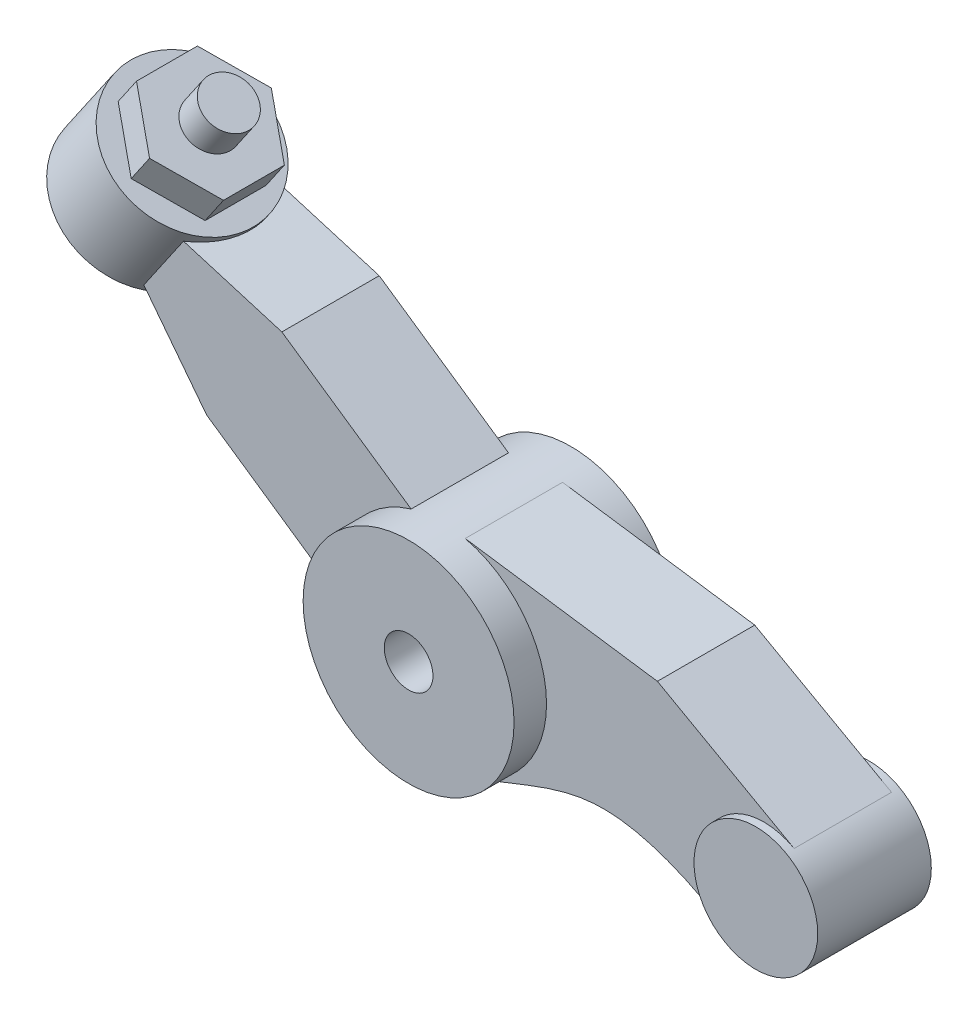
ISO-10303-21;
HEADER;
FILE_DESCRIPTION(('STEP AP214'),'2;1');
FILE_NAME('part.step','',(''),(''),'','','');
FILE_SCHEMA(('AUTOMOTIVE_DESIGN { 1 0 10303 214 1 1 1 1 }'));
ENDSEC;
DATA;
#1=APPLICATION_CONTEXT('core data for automotive mechanical design processes');
#2=APPLICATION_PROTOCOL_DEFINITION('international standard','automotive_design',2000,#1);
#3=PRODUCT_CONTEXT('',#1,'mechanical');
#4=PRODUCT('Part','Part','',(#3));
#5=PRODUCT_RELATED_PRODUCT_CATEGORY('part','',(#4));
#6=PRODUCT_DEFINITION_FORMATION('','',#4);
#7=PRODUCT_DEFINITION_CONTEXT('part definition',#1,'design');
#8=PRODUCT_DEFINITION('design','',#6,#7);
#9=PRODUCT_DEFINITION_SHAPE('','',#8);
#10=(LENGTH_UNIT() NAMED_UNIT(*) SI_UNIT(.MILLI.,.METRE.));
#11=(NAMED_UNIT(*) PLANE_ANGLE_UNIT() SI_UNIT($,.RADIAN.));
#12=(NAMED_UNIT(*) SI_UNIT($,.STERADIAN.) SOLID_ANGLE_UNIT());
#13=UNCERTAINTY_MEASURE_WITH_UNIT(LENGTH_MEASURE(1.E-05),#10,'distance_accuracy_value','');
#14=(GEOMETRIC_REPRESENTATION_CONTEXT(3) GLOBAL_UNCERTAINTY_ASSIGNED_CONTEXT((#13)) GLOBAL_UNIT_ASSIGNED_CONTEXT((#10,
#11,#12)) REPRESENTATION_CONTEXT('',''));
#15=CARTESIAN_POINT('',(0.,0.,0.));
#16=DIRECTION('',(0.,0.,1.));
#17=DIRECTION('',(1.,0.,0.));
#18=AXIS2_PLACEMENT_3D('',#15,#16,#17);
#19=CARTESIAN_POINT('',(0.,0.,1.));
#20=DIRECTION('',(0.,0.,-1.));
#21=DIRECTION('',(-1.,0.,0.));
#22=AXIS2_PLACEMENT_3D('',#19,#20,#21);
#23=CYLINDRICAL_SURFACE('',#22,0.3);
#24=CARTESIAN_POINT('',(0.,0.,1.));
#25=DIRECTION('',(0.,0.,1.));
#26=DIRECTION('',(1.,0.,0.));
#27=AXIS2_PLACEMENT_3D('',#24,#25,#26);
#28=CIRCLE('',#27,0.3);
#29=CARTESIAN_POINT('',(0.3,0.,1.));
#30=VERTEX_POINT('',#29);
#31=EDGE_CURVE('E289',#30,#30,#28,.T.);
#32=ORIENTED_EDGE('',*,*,#31,.T.);
#33=EDGE_LOOP('',(#32));
#34=FACE_BOUND('',#33,.T.);
#35=CARTESIAN_POINT('',(0.,0.,-1.));
#36=DIRECTION('',(0.,0.,1.));
#37=DIRECTION('',(1.,0.,0.));
#38=AXIS2_PLACEMENT_3D('',#35,#36,#37);
#39=CIRCLE('',#38,0.3);
#40=CARTESIAN_POINT('',(0.3,0.,-1.));
#41=VERTEX_POINT('',#40);
#42=EDGE_CURVE('E290',#41,#41,#39,.T.);
#43=ORIENTED_EDGE('',*,*,#42,.F.);
#44=EDGE_LOOP('',(#43));
#45=FACE_BOUND('',#44,.T.);
#46=ADVANCED_FACE('F38',(#34,#45),#23,.F.);
#47=CARTESIAN_POINT('',(0.,0.,1.));
#48=DIRECTION('',(0.,0.,-1.));
#49=DIRECTION('',(-1.,0.,0.));
#50=AXIS2_PLACEMENT_3D('',#47,#48,#49);
#51=CYLINDRICAL_SURFACE('',#50,1.3);
#52=DIRECTION('',(0.,0.,-1.));
#53=VECTOR('',#52,1.);
#54=CARTESIAN_POINT('',(-0.368782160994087,1.24659525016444,0.6));
#55=LINE('',#54,#53);
#56=CARTESIAN_POINT('',(-0.368782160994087,1.24659525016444,0.6));
#57=VERTEX_POINT('',#56);
#58=CARTESIAN_POINT('',(-0.368782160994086,1.24659525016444,-0.6));
#59=VERTEX_POINT('',#58);
#60=EDGE_CURVE('E232',#57,#59,#55,.T.);
#61=ORIENTED_EDGE('',*,*,#60,.F.);
#62=CARTESIAN_POINT('',(0.,0.,0.6));
#63=DIRECTION('',(0.,0.,1.));
#64=DIRECTION('',(1.,0.,0.));
#65=AXIS2_PLACEMENT_3D('',#62,#63,#64);
#66=CIRCLE('',#65,1.3);
#67=CARTESIAN_POINT('',(-1.29584863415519,-0.103809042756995,0.6));
#68=VERTEX_POINT('',#67);
#69=EDGE_CURVE('E200',#57,#68,#66,.T.);
#70=ORIENTED_EDGE('',*,*,#69,.T.);
#71=DIRECTION('',(0.,0.,-1.));
#72=VECTOR('',#71,1.);
#73=CARTESIAN_POINT('',(-1.29584863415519,-0.103809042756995,0.6));
#74=LINE('',#73,#72);
#75=CARTESIAN_POINT('',(-1.29584863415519,-0.103809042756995,-0.6));
#76=VERTEX_POINT('',#75);
#77=EDGE_CURVE('E213',#68,#76,#74,.T.);
#78=ORIENTED_EDGE('',*,*,#77,.T.);
#79=CARTESIAN_POINT('',(0.,0.,-0.6));
#80=DIRECTION('',(0.,0.,1.));
#81=DIRECTION('',(1.,0.,0.));
#82=AXIS2_PLACEMENT_3D('',#79,#80,#81);
#83=CIRCLE('',#82,1.3);
#84=EDGE_CURVE('E199',#59,#76,#83,.T.);
#85=ORIENTED_EDGE('',*,*,#84,.F.);
#86=EDGE_LOOP('',(#61,#70,#78,#85));
#87=FACE_BOUND('',#86,.T.);
#88=DIRECTION('',(0.,0.,-1.));
#89=VECTOR('',#88,1.);
#90=CARTESIAN_POINT('',(0.478482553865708,-1.20874085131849,0.6));
#91=LINE('',#90,#89);
#92=CARTESIAN_POINT('',(0.478482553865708,-1.20874085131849,0.6));
#93=VERTEX_POINT('',#92);
#94=CARTESIAN_POINT('',(0.478482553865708,-1.20874085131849,-0.6));
#95=VERTEX_POINT('',#94);
#96=EDGE_CURVE('E280',#93,#95,#91,.T.);
#97=ORIENTED_EDGE('',*,*,#96,.F.);
#98=CARTESIAN_POINT('',(0.,0.,0.6));
#99=DIRECTION('',(0.,0.,1.));
#100=DIRECTION('',(1.,0.,0.));
#101=AXIS2_PLACEMENT_3D('',#98,#99,#100);
#102=CIRCLE('',#101,1.3);
#103=CARTESIAN_POINT('',(0.297716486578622,1.26545047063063,0.6));
#104=VERTEX_POINT('',#103);
#105=EDGE_CURVE('E313',#93,#104,#102,.T.);
#106=ORIENTED_EDGE('',*,*,#105,.T.);
#107=DIRECTION('',(0.,0.,-1.));
#108=VECTOR('',#107,1.);
#109=CARTESIAN_POINT('',(0.297716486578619,1.26545047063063,0.6));
#110=LINE('',#109,#108);
#111=CARTESIAN_POINT('',(0.297716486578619,1.26545047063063,-0.6));
#112=VERTEX_POINT('',#111);
#113=EDGE_CURVE('E310',#104,#112,#110,.T.);
#114=ORIENTED_EDGE('',*,*,#113,.T.);
#115=CARTESIAN_POINT('',(0.,0.,-0.6));
#116=DIRECTION('',(0.,0.,1.));
#117=DIRECTION('',(1.,0.,0.));
#118=AXIS2_PLACEMENT_3D('',#115,#116,#117);
#119=CIRCLE('',#118,1.3);
#120=EDGE_CURVE('E249',#95,#112,#119,.T.);
#121=ORIENTED_EDGE('',*,*,#120,.F.);
#122=EDGE_LOOP('',(#97,#106,#114,#121));
#123=FACE_BOUND('',#122,.T.);
#124=CARTESIAN_POINT('',(0.,0.,1.));
#125=DIRECTION('',(0.,0.,1.));
#126=DIRECTION('',(1.,0.,0.));
#127=AXIS2_PLACEMENT_3D('',#124,#125,#126);
#128=CIRCLE('',#127,1.3);
#129=CARTESIAN_POINT('',(1.3,0.,1.));
#130=VERTEX_POINT('',#129);
#131=EDGE_CURVE('E284',#130,#130,#128,.T.);
#132=ORIENTED_EDGE('',*,*,#131,.F.);
#133=EDGE_LOOP('',(#132));
#134=FACE_BOUND('',#133,.T.);
#135=CARTESIAN_POINT('',(0.,0.,-1.));
#136=DIRECTION('',(0.,0.,1.));
#137=DIRECTION('',(1.,0.,0.));
#138=AXIS2_PLACEMENT_3D('',#135,#136,#137);
#139=CIRCLE('',#138,1.3);
#140=CARTESIAN_POINT('',(1.3,0.,-1.));
#141=VERTEX_POINT('',#140);
#142=EDGE_CURVE('E287',#141,#141,#139,.T.);
#143=ORIENTED_EDGE('',*,*,#142,.T.);
#144=EDGE_LOOP('',(#143));
#145=FACE_BOUND('',#144,.T.);
#146=ADVANCED_FACE('F266',(#87,#123,#134,#145),#51,.T.);
#147=CARTESIAN_POINT('',(0.,0.,1.));
#148=DIRECTION('',(0.,0.,1.));
#149=DIRECTION('',(1.,0.,0.));
#150=AXIS2_PLACEMENT_3D('',#147,#148,#149);
#151=PLANE('',#150);
#152=ORIENTED_EDGE('',*,*,#31,.F.);
#153=EDGE_LOOP('',(#152));
#154=FACE_BOUND('',#153,.T.);
#155=ORIENTED_EDGE('',*,*,#131,.T.);
#156=EDGE_LOOP('',(#155));
#157=FACE_BOUND('',#156,.T.);
#158=ADVANCED_FACE('F263',(#154,#157),#151,.T.);
#159=CARTESIAN_POINT('',(0.,0.,-1.));
#160=DIRECTION('',(0.,0.,1.));
#161=DIRECTION('',(1.,0.,0.));
#162=AXIS2_PLACEMENT_3D('',#159,#160,#161);
#163=PLANE('',#162);
#164=ORIENTED_EDGE('',*,*,#42,.T.);
#165=EDGE_LOOP('',(#164));
#166=FACE_BOUND('',#165,.T.);
#167=ORIENTED_EDGE('',*,*,#142,.F.);
#168=EDGE_LOOP('',(#167));
#169=FACE_BOUND('',#168,.T.);
#170=ADVANCED_FACE('F260',(#166,#169),#163,.F.);
#171=CARTESIAN_POINT('',(3.50770115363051,-1.28061510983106,0.6));
#172=CARTESIAN_POINT('',(3.03919755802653,-0.994556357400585,0.6));
#173=CARTESIAN_POINT('',(1.95117461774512,-0.508065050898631,0.6));
#174=CARTESIAN_POINT('',(0.933637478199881,-1.05358892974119,0.6));
#175=CARTESIAN_POINT('',(0.478482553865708,-1.20874085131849,0.6));
#176=B_SPLINE_CURVE_WITH_KNOTS('',3,(#171,#172,#173,#174,#175),.UNSPECIFIED.,.F.,.F.,(4,1,4),
(0.,0.533404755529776,1.),.UNSPECIFIED.);
#177=DIRECTION('',(0.,0.,-1.));
#178=VECTOR('',#177,1.);
#179=SURFACE_OF_LINEAR_EXTRUSION('',#176,#178);
#180=CARTESIAN_POINT('',(3.50770115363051,-1.28061510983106,-0.6));
#181=CARTESIAN_POINT('',(3.03919755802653,-0.994556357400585,-0.6));
#182=CARTESIAN_POINT('',(1.95117461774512,-0.508065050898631,-0.6));
#183=CARTESIAN_POINT('',(0.933637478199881,-1.05358892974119,-0.6));
#184=CARTESIAN_POINT('',(0.478482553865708,-1.20874085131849,-0.6));
#185=B_SPLINE_CURVE_WITH_KNOTS('',3,(#180,#181,#182,#183,#184),.UNSPECIFIED.,.F.,.F.,(4,1,4),
(0.,0.533404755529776,1.),.UNSPECIFIED.);
#186=CARTESIAN_POINT('',(3.50770115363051,-1.28061510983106,-0.6));
#187=VERTEX_POINT('',#186);
#188=EDGE_CURVE('E239',#187,#95,#185,.T.);
#189=ORIENTED_EDGE('',*,*,#188,.F.);
#190=DIRECTION('',(0.,0.,-1.));
#191=VECTOR('',#190,1.);
#192=CARTESIAN_POINT('',(3.50770115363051,-1.28061510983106,0.6));
#193=LINE('',#192,#191);
#194=CARTESIAN_POINT('',(3.50770115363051,-1.28061510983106,0.6));
#195=VERTEX_POINT('',#194);
#196=EDGE_CURVE('E295',#195,#187,#193,.T.);
#197=ORIENTED_EDGE('',*,*,#196,.F.);
#198=EDGE_CURVE('E242',#195,#93,#176,.T.);
#199=ORIENTED_EDGE('',*,*,#198,.T.);
#200=ORIENTED_EDGE('',*,*,#96,.T.);
#201=EDGE_LOOP('',(#189,#197,#199,#200));
#202=FACE_BOUND('',#201,.T.);
#203=ADVANCED_FACE('F255',(#202),#179,.T.);
#204=CARTESIAN_POINT('',(1.02851200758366,1.84066803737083,0.6));
#205=DIRECTION('',(0.48778644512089,0.872962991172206,0.));
#206=DIRECTION('',(-0.872962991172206,0.48778644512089,0.));
#207=AXIS2_PLACEMENT_3D('',#204,#205,#206);
#208=PLANE('',#207);
#209=DIRECTION('',(0.872962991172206,-0.48778644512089,0.));
#210=VECTOR('',#209,1.);
#211=CARTESIAN_POINT('',(1.02851200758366,1.84066803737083,-0.6));
#212=LINE('',#211,#210);
#213=CARTESIAN_POINT('',(2.66637346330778,0.925478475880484,-0.6));
#214=VERTEX_POINT('',#213);
#215=CARTESIAN_POINT('',(4.35193716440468,-0.0163657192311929,-0.6));
#216=VERTEX_POINT('',#215);
#217=EDGE_CURVE('E319',#214,#216,#212,.T.);
#218=ORIENTED_EDGE('',*,*,#217,.F.);
#219=DIRECTION('',(0.,0.,-1.));
#220=VECTOR('',#219,1.);
#221=CARTESIAN_POINT('',(2.66637346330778,0.925478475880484,0.6));
#222=LINE('',#221,#220);
#223=CARTESIAN_POINT('',(2.66637346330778,0.925478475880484,0.6));
#224=VERTEX_POINT('',#223);
#225=EDGE_CURVE('E308',#224,#214,#222,.T.);
#226=ORIENTED_EDGE('',*,*,#225,.F.);
#227=DIRECTION('',(0.872962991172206,-0.48778644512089,0.));
#228=VECTOR('',#227,1.);
#229=CARTESIAN_POINT('',(1.02851200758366,1.84066803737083,0.6));
#230=LINE('',#229,#228);
#231=CARTESIAN_POINT('',(4.35193716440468,-0.0163657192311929,0.6));
#232=VERTEX_POINT('',#231);
#233=EDGE_CURVE('E335',#224,#232,#230,.T.);
#234=ORIENTED_EDGE('',*,*,#233,.T.);
#235=DIRECTION('',(0.,0.,-1.));
#236=VECTOR('',#235,1.);
#237=CARTESIAN_POINT('',(4.35193716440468,-0.0163657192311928,0.6));
#238=LINE('',#237,#236);
#239=EDGE_CURVE('E305',#232,#216,#238,.T.);
#240=ORIENTED_EDGE('',*,*,#239,.T.);
#241=EDGE_LOOP('',(#218,#226,#234,#240));
#242=FACE_BOUND('',#241,.T.);
#243=ADVANCED_FACE('F259',(#242),#208,.T.);
#244=CARTESIAN_POINT('',(0.183972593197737,1.28177606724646,0.6));
#245=DIRECTION('',(0.142073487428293,0.989856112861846,0.));
#246=DIRECTION('',(-0.989856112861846,0.142073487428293,0.));
#247=AXIS2_PLACEMENT_3D('',#244,#245,#246);
#248=PLANE('',#247);
#249=DIRECTION('',(0.989856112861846,-0.142073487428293,0.));
#250=VECTOR('',#249,1.);
#251=CARTESIAN_POINT('',(0.183972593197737,1.28177606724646,-0.6));
#252=LINE('',#251,#250);
#253=EDGE_CURVE('E316',#112,#214,#252,.T.);
#254=ORIENTED_EDGE('',*,*,#253,.F.);
#255=ORIENTED_EDGE('',*,*,#113,.F.);
#256=DIRECTION('',(0.989856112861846,-0.142073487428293,0.));
#257=VECTOR('',#256,1.);
#258=CARTESIAN_POINT('',(0.183972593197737,1.28177606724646,0.6));
#259=LINE('',#258,#257);
#260=EDGE_CURVE('E333',#104,#224,#259,.T.);
#261=ORIENTED_EDGE('',*,*,#260,.T.);
#262=ORIENTED_EDGE('',*,*,#225,.T.);
#263=EDGE_LOOP('',(#254,#255,#261,#262));
#264=FACE_BOUND('',#263,.T.);
#265=ADVANCED_FACE('F353',(#264),#248,.T.);
#266=CARTESIAN_POINT('',(0.,0.,0.6));
#267=DIRECTION('',(0.,0.,1.));
#268=DIRECTION('',(1.,0.,0.));
#269=AXIS2_PLACEMENT_3D('',#266,#267,#268);
#270=PLANE('',#269);
#271=ORIENTED_EDGE('',*,*,#198,.F.);
#272=CARTESIAN_POINT('',(3.98,-0.682,0.6));
#273=DIRECTION('',(0.,0.,1.));
#274=DIRECTION('',(1.,0.,0.));
#275=AXIS2_PLACEMENT_3D('',#272,#273,#274);
#276=CIRCLE('',#275,0.7625);
#277=EDGE_CURVE('E248',#232,#195,#276,.T.);
#278=ORIENTED_EDGE('',*,*,#277,.F.);
#279=ORIENTED_EDGE('',*,*,#233,.F.);
#280=ORIENTED_EDGE('',*,*,#260,.F.);
#281=ORIENTED_EDGE('',*,*,#105,.F.);
#282=EDGE_LOOP('',(#271,#278,#279,#280,#281));
#283=FACE_BOUND('',#282,.T.);
#284=ADVANCED_FACE('F348',(#283),#270,.T.);
#285=CARTESIAN_POINT('',(0.,0.,-0.6));
#286=DIRECTION('',(0.,0.,1.));
#287=DIRECTION('',(1.,0.,0.));
#288=AXIS2_PLACEMENT_3D('',#285,#286,#287);
#289=PLANE('',#288);
#290=ORIENTED_EDGE('',*,*,#188,.T.);
#291=ORIENTED_EDGE('',*,*,#120,.T.);
#292=ORIENTED_EDGE('',*,*,#253,.T.);
#293=ORIENTED_EDGE('',*,*,#217,.T.);
#294=CARTESIAN_POINT('',(3.98,-0.682,-0.6));
#295=DIRECTION('',(0.,0.,1.));
#296=DIRECTION('',(1.,0.,0.));
#297=AXIS2_PLACEMENT_3D('',#294,#295,#296);
#298=CIRCLE('',#297,0.7625);
#299=EDGE_CURVE('E322',#216,#187,#298,.T.);
#300=ORIENTED_EDGE('',*,*,#299,.T.);
#301=EDGE_LOOP('',(#290,#291,#292,#293,#300));
#302=FACE_BOUND('',#301,.T.);
#303=ADVANCED_FACE('F356',(#302),#289,.F.);
#304=CARTESIAN_POINT('',(3.98,-0.682,0.7));
#305=DIRECTION('',(0.,0.,-1.));
#306=DIRECTION('',(-1.,0.,0.));
#307=AXIS2_PLACEMENT_3D('',#304,#305,#306);
#308=CYLINDRICAL_SURFACE('',#307,0.7625);
#309=ORIENTED_EDGE('',*,*,#277,.T.);
#310=ORIENTED_EDGE('',*,*,#196,.T.);
#311=ORIENTED_EDGE('',*,*,#299,.F.);
#312=ORIENTED_EDGE('',*,*,#239,.F.);
#313=EDGE_LOOP('',(#309,#310,#311,#312));
#314=FACE_BOUND('',#313,.T.);
#315=CARTESIAN_POINT('',(3.98,-0.682,0.7));
#316=DIRECTION('',(0.,0.,1.));
#317=DIRECTION('',(1.,0.,0.));
#318=AXIS2_PLACEMENT_3D('',#315,#316,#317);
#319=CIRCLE('',#318,0.7625);
#320=CARTESIAN_POINT('',(4.7425,-0.682,0.7));
#321=VERTEX_POINT('',#320);
#322=EDGE_CURVE('E236',#321,#321,#319,.T.);
#323=ORIENTED_EDGE('',*,*,#322,.F.);
#324=EDGE_LOOP('',(#323));
#325=FACE_BOUND('',#324,.T.);
#326=CARTESIAN_POINT('',(3.98,-0.682,-0.7));
#327=DIRECTION('',(0.,0.,1.));
#328=DIRECTION('',(1.,0.,0.));
#329=AXIS2_PLACEMENT_3D('',#326,#327,#328);
#330=CIRCLE('',#329,0.7625);
#331=CARTESIAN_POINT('',(4.7425,-0.682,-0.7));
#332=VERTEX_POINT('',#331);
#333=EDGE_CURVE('E235',#332,#332,#330,.T.);
#334=ORIENTED_EDGE('',*,*,#333,.T.);
#335=EDGE_LOOP('',(#334));
#336=FACE_BOUND('',#335,.T.);
#337=ADVANCED_FACE('F342',(#314,#325,#336),#308,.T.);
#338=CARTESIAN_POINT('',(0.,0.,0.7));
#339=DIRECTION('',(0.,0.,1.));
#340=DIRECTION('',(1.,0.,0.));
#341=AXIS2_PLACEMENT_3D('',#338,#339,#340);
#342=PLANE('',#341);
#343=ORIENTED_EDGE('',*,*,#322,.T.);
#344=EDGE_LOOP('',(#343));
#345=FACE_BOUND('',#344,.T.);
#346=ADVANCED_FACE('F370',(#345),#342,.T.);
#347=CARTESIAN_POINT('',(0.,0.,-0.7));
#348=DIRECTION('',(0.,0.,1.));
#349=DIRECTION('',(1.,0.,0.));
#350=AXIS2_PLACEMENT_3D('',#347,#348,#349);
#351=PLANE('',#350);
#352=ORIENTED_EDGE('',*,*,#333,.F.);
#353=EDGE_LOOP('',(#352));
#354=FACE_BOUND('',#353,.T.);
#355=ADVANCED_FACE('F371',(#354),#351,.F.);
#356=CARTESIAN_POINT('',(0.463533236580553,0.675202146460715,0.6));
#357=DIRECTION('',(0.565974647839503,0.824422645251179,0.));
#358=DIRECTION('',(-0.824422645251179,0.565974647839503,0.));
#359=AXIS2_PLACEMENT_3D('',#356,#357,#358);
#360=PLANE('',#359);
#361=DIRECTION('',(0.824422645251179,-0.565974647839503,0.));
#362=VECTOR('',#361,1.);
#363=CARTESIAN_POINT('',(0.463533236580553,0.675202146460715,-0.6));
#364=LINE('',#363,#362);
#365=CARTESIAN_POINT('',(-1.96205705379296,2.3403948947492,-0.6));
#366=VERTEX_POINT('',#365);
#367=EDGE_CURVE('E216',#366,#59,#364,.T.);
#368=ORIENTED_EDGE('',*,*,#367,.F.);
#369=DIRECTION('',(0.,0.,-1.));
#370=VECTOR('',#369,1.);
#371=CARTESIAN_POINT('',(-1.96205705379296,2.3403948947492,0.6));
#372=LINE('',#371,#370);
#373=CARTESIAN_POINT('',(-1.96205705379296,2.3403948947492,0.6));
#374=VERTEX_POINT('',#373);
#375=EDGE_CURVE('E229',#374,#366,#372,.T.);
#376=ORIENTED_EDGE('',*,*,#375,.F.);
#377=DIRECTION('',(0.824422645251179,-0.565974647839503,0.));
#378=VECTOR('',#377,1.);
#379=CARTESIAN_POINT('',(0.463533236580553,0.675202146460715,0.6));
#380=LINE('',#379,#378);
#381=EDGE_CURVE('E202',#374,#57,#380,.T.);
#382=ORIENTED_EDGE('',*,*,#381,.T.);
#383=ORIENTED_EDGE('',*,*,#60,.T.);
#384=EDGE_LOOP('',(#368,#376,#382,#383));
#385=FACE_BOUND('',#384,.T.);
#386=ADVANCED_FACE('F374',(#385),#360,.T.);
#387=CARTESIAN_POINT('',(0.481375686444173,1.60968914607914,0.6));
#388=DIRECTION('',(0.286511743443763,0.958076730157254,0.));
#389=DIRECTION('',(-0.958076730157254,0.286511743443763,0.));
#390=AXIS2_PLACEMENT_3D('',#387,#388,#389);
#391=PLANE('',#390);
#392=CARTESIAN_POINT('',(-3.86693369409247,2.91004606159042,0.));
#393=DIRECTION('',(0.286511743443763,0.958076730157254,0.));
#394=DIRECTION('',(0.958076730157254,-0.286511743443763,0.));
#395=AXIS2_PLACEMENT_3D('',#392,#393,#394);
#396=ELLIPSE('',#395,0.959014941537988,0.913);
#397=CARTESIAN_POINT('',(-3.17439104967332,2.70294198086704,0.6));
#398=VERTEX_POINT('',#397);
#399=CARTESIAN_POINT('',(-3.17439104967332,2.70294198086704,-0.6));
#400=VERTEX_POINT('',#399);
#401=EDGE_CURVE('E195',#398,#400,#396,.T.);
#402=ORIENTED_EDGE('',*,*,#401,.F.);
#403=DIRECTION('',(0.958076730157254,-0.286511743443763,0.));
#404=VECTOR('',#403,1.);
#405=CARTESIAN_POINT('',(0.481375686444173,1.60968914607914,0.6));
#406=LINE('',#405,#404);
#407=EDGE_CURVE('E206',#398,#374,#406,.T.);
#408=ORIENTED_EDGE('',*,*,#407,.T.);
#409=ORIENTED_EDGE('',*,*,#375,.T.);
#410=DIRECTION('',(0.958076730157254,-0.286511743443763,0.));
#411=VECTOR('',#410,1.);
#412=CARTESIAN_POINT('',(0.481375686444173,1.60968914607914,-0.6));
#413=LINE('',#412,#411);
#414=EDGE_CURVE('E219',#400,#366,#413,.T.);
#415=ORIENTED_EDGE('',*,*,#414,.F.);
#416=EDGE_LOOP('',(#402,#408,#409,#415));
#417=FACE_BOUND('',#416,.T.);
#418=ADVANCED_FACE('F381',(#417),#391,.T.);
#419=CARTESIAN_POINT('',(-1.32918923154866,-1.02765640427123,0.6));
#420=DIRECTION('',(0.791124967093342,0.611654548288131,0.));
#421=DIRECTION('',(-0.611654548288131,0.791124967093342,0.));
#422=AXIS2_PLACEMENT_3D('',#419,#420,#421);
#423=PLANE('',#422);
#424=DIRECTION('',(0.611654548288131,-0.791124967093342,0.));
#425=VECTOR('',#424,1.);
#426=CARTESIAN_POINT('',(-1.32918923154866,-1.02765640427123,0.6));
#427=LINE('',#426,#425);
#428=CARTESIAN_POINT('',(-3.66310078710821,1.99106667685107,0.6));
#429=VERTEX_POINT('',#428);
#430=CARTESIAN_POINT('',(-2.88912352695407,0.989990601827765,0.6));
#431=VERTEX_POINT('',#430);
#432=EDGE_CURVE('E208',#429,#431,#427,.T.);
#433=ORIENTED_EDGE('',*,*,#432,.F.);
#434=CARTESIAN_POINT('',(-4.10523328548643,2.56292878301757,0.));
#435=DIRECTION('',(0.791124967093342,0.611654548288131,0.));
#436=DIRECTION('',(-0.611654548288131,0.791124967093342,0.));
#437=AXIS2_PLACEMENT_3D('',#434,#435,#436);
#438=ELLIPSE('',#437,0.959014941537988,0.913);
#439=CARTESIAN_POINT('',(-3.66310078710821,1.99106667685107,-0.6));
#440=VERTEX_POINT('',#439);
#441=EDGE_CURVE('E192',#429,#440,#438,.T.);
#442=ORIENTED_EDGE('',*,*,#441,.T.);
#443=DIRECTION('',(0.611654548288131,-0.791124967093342,0.));
#444=VECTOR('',#443,1.);
#445=CARTESIAN_POINT('',(-1.32918923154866,-1.02765640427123,-0.6));
#446=LINE('',#445,#444);
#447=CARTESIAN_POINT('',(-2.88912352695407,0.989990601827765,-0.6));
#448=VERTEX_POINT('',#447);
#449=EDGE_CURVE('E221',#440,#448,#446,.T.);
#450=ORIENTED_EDGE('',*,*,#449,.T.);
#451=DIRECTION('',(0.,0.,-1.));
#452=VECTOR('',#451,1.);
#453=CARTESIAN_POINT('',(-2.88912352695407,0.989990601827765,0.6));
#454=LINE('',#453,#452);
#455=EDGE_CURVE('E226',#431,#448,#454,.T.);
#456=ORIENTED_EDGE('',*,*,#455,.F.);
#457=EDGE_LOOP('',(#433,#442,#450,#456));
#458=FACE_BOUND('',#457,.T.);
#459=ADVANCED_FACE('F385',(#458),#423,.F.);
#460=CARTESIAN_POINT('',(-0.463533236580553,-0.675202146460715,0.6));
#461=DIRECTION('',(0.565974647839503,0.824422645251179,0.));
#462=DIRECTION('',(-0.824422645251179,0.565974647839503,0.));
#463=AXIS2_PLACEMENT_3D('',#460,#461,#462);
#464=PLANE('',#463);
#465=DIRECTION('',(0.824422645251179,-0.565974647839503,0.));
#466=VECTOR('',#465,1.);
#467=CARTESIAN_POINT('',(-0.463533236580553,-0.675202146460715,-0.6));
#468=LINE('',#467,#466);
#469=EDGE_CURVE('E203',#448,#76,#468,.T.);
#470=ORIENTED_EDGE('',*,*,#469,.T.);
#471=ORIENTED_EDGE('',*,*,#77,.F.);
#472=DIRECTION('',(0.824422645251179,-0.565974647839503,0.));
#473=VECTOR('',#472,1.);
#474=CARTESIAN_POINT('',(-0.463533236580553,-0.675202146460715,0.6));
#475=LINE('',#474,#473);
#476=EDGE_CURVE('E210',#431,#68,#475,.T.);
#477=ORIENTED_EDGE('',*,*,#476,.F.);
#478=ORIENTED_EDGE('',*,*,#455,.T.);
#479=EDGE_LOOP('',(#470,#471,#477,#478));
#480=FACE_BOUND('',#479,.T.);
#481=ADVANCED_FACE('F389',(#480),#464,.F.);
#482=CARTESIAN_POINT('',(0.,0.,0.6));
#483=DIRECTION('',(0.,0.,1.));
#484=DIRECTION('',(1.,0.,0.));
#485=AXIS2_PLACEMENT_3D('',#482,#483,#484);
#486=PLANE('',#485);
#487=DIRECTION('',(0.565974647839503,0.824422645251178,0.));
#488=VECTOR('',#487,1.);
#489=CARTESIAN_POINT('',(-3.10119538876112,2.80956188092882,0.6));
#490=LINE('',#489,#488);
#491=EDGE_CURVE('E197',#429,#398,#490,.T.);
#492=ORIENTED_EDGE('',*,*,#491,.F.);
#493=ORIENTED_EDGE('',*,*,#432,.T.);
#494=ORIENTED_EDGE('',*,*,#476,.T.);
#495=ORIENTED_EDGE('',*,*,#69,.F.);
#496=ORIENTED_EDGE('',*,*,#381,.F.);
#497=ORIENTED_EDGE('',*,*,#407,.F.);
#498=EDGE_LOOP('',(#492,#493,#494,#495,#496,#497));
#499=FACE_BOUND('',#498,.T.);
#500=ADVANCED_FACE('F393',(#499),#486,.T.);
#501=CARTESIAN_POINT('',(0.,0.,-0.6));
#502=DIRECTION('',(0.,0.,1.));
#503=DIRECTION('',(1.,0.,0.));
#504=AXIS2_PLACEMENT_3D('',#501,#502,#503);
#505=PLANE('',#504);
#506=ORIENTED_EDGE('',*,*,#449,.F.);
#507=DIRECTION('',(0.565974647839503,0.824422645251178,0.));
#508=VECTOR('',#507,1.);
#509=CARTESIAN_POINT('',(-3.10119538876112,2.80956188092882,-0.6));
#510=LINE('',#509,#508);
#511=EDGE_CURVE('E46',#440,#400,#510,.T.);
#512=ORIENTED_EDGE('',*,*,#511,.T.);
#513=ORIENTED_EDGE('',*,*,#414,.T.);
#514=ORIENTED_EDGE('',*,*,#367,.T.);
#515=ORIENTED_EDGE('',*,*,#84,.T.);
#516=ORIENTED_EDGE('',*,*,#469,.F.);
#517=EDGE_LOOP('',(#506,#512,#513,#514,#515,#516));
#518=FACE_BOUND('',#517,.T.);
#519=ADVANCED_FACE('F395',(#518),#505,.F.);
#520=CARTESIAN_POINT('',(-4.42123083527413,3.71577982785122,0.));
#521=DIRECTION('',(0.565974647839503,0.824422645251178,0.));
#522=DIRECTION('',(-0.824422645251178,0.565974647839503,0.));
#523=AXIS2_PLACEMENT_3D('',#520,#521,#522);
#524=PLANE('',#523);
#525=DIRECTION('',(-0.713970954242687,0.490148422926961,-0.5));
#526=VECTOR('',#525,1.);
#527=CARTESIAN_POINT('',(-3.13265824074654,2.83116145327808,-0.375277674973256));
#528=LINE('',#527,#526);
#529=CARTESIAN_POINT('',(-3.13265824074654,2.83116145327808,-0.375277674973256));
#530=VERTEX_POINT('',#529);
#531=CARTESIAN_POINT('',(-3.6685329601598,3.19904497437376,-0.750555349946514));
#532=VERTEX_POINT('',#531);
#533=EDGE_CURVE('E54',#530,#532,#528,.T.);
#534=ORIENTED_EDGE('',*,*,#533,.F.);
#535=DIRECTION('',(0.,0.,-1.));
#536=VECTOR('',#535,1.);
#537=CARTESIAN_POINT('',(-3.13265824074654,2.83116145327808,0.375277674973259));
#538=LINE('',#537,#536);
#539=CARTESIAN_POINT('',(-3.13265824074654,2.83116145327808,0.375277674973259));
#540=VERTEX_POINT('',#539);
#541=EDGE_CURVE('E58',#540,#530,#538,.T.);
#542=ORIENTED_EDGE('',*,*,#541,.F.);
#543=DIRECTION('',(0.713970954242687,-0.490148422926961,-0.499999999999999));
#544=VECTOR('',#543,1.);
#545=CARTESIAN_POINT('',(-3.6685329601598,3.19904497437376,0.750555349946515));
#546=LINE('',#545,#544);
#547=CARTESIAN_POINT('',(-3.6685329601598,3.19904497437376,0.750555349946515));
#548=VERTEX_POINT('',#547);
#549=EDGE_CURVE('E473',#548,#540,#546,.T.);
#550=ORIENTED_EDGE('',*,*,#549,.F.);
#551=DIRECTION('',(0.713970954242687,-0.490148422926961,0.5));
#552=VECTOR('',#551,1.);
#553=CARTESIAN_POINT('',(-4.20440767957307,3.56692849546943,0.375277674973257));
#554=LINE('',#553,#552);
#555=CARTESIAN_POINT('',(-4.20440767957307,3.56692849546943,0.375277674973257));
#556=VERTEX_POINT('',#555);
#557=EDGE_CURVE('E470',#556,#548,#554,.T.);
#558=ORIENTED_EDGE('',*,*,#557,.F.);
#559=DIRECTION('',(0.,0.,1.));
#560=VECTOR('',#559,1.);
#561=CARTESIAN_POINT('',(-4.20440767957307,3.56692849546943,-0.375277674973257));
#562=LINE('',#561,#560);
#563=CARTESIAN_POINT('',(-4.20440767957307,3.56692849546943,-0.375277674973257));
#564=VERTEX_POINT('',#563);
#565=EDGE_CURVE('E467',#564,#556,#562,.T.);
#566=ORIENTED_EDGE('',*,*,#565,.F.);
#567=DIRECTION('',(-0.713970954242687,0.490148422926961,0.5));
#568=VECTOR('',#567,1.);
#569=CARTESIAN_POINT('',(-3.6685329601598,3.19904497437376,-0.750555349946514));
#570=LINE('',#569,#568);
#571=EDGE_CURVE('E456',#532,#564,#570,.T.);
#572=ORIENTED_EDGE('',*,*,#571,.F.);
#573=EDGE_LOOP('',(#534,#542,#550,#558,#566,#572));
#574=FACE_BOUND('',#573,.T.);
#575=CARTESIAN_POINT('',(-3.6685329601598,3.19904497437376,0.));
#576=DIRECTION('',(0.565974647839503,0.824422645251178,0.));
#577=DIRECTION('',(-0.824422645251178,0.565974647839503,0.));
#578=AXIS2_PLACEMENT_3D('',#575,#576,#577);
#579=CIRCLE('',#578,0.913);
#580=CARTESIAN_POINT('',(-4.42123083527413,3.71577982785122,0.));
#581=VERTEX_POINT('',#580);
#582=EDGE_CURVE('E186',#581,#581,#579,.T.);
#583=ORIENTED_EDGE('',*,*,#582,.T.);
#584=EDGE_LOOP('',(#583));
#585=FACE_BOUND('',#584,.T.);
#586=ADVANCED_FACE('F398',(#574,#585),#524,.T.);
#587=CARTESIAN_POINT('',(-4.27752168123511,2.31196620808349,0.));
#588=DIRECTION('',(-0.565974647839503,-0.824422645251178,0.));
#589=DIRECTION('',(0.824422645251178,-0.565974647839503,0.));
#590=AXIS2_PLACEMENT_3D('',#587,#588,#589);
#591=PLANE('',#590);
#592=CARTESIAN_POINT('',(-4.27752168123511,2.31196620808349,0.));
#593=DIRECTION('',(-0.565974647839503,-0.824422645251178,0.));
#594=DIRECTION('',(0.824422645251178,-0.565974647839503,0.));
#595=AXIS2_PLACEMENT_3D('',#592,#593,#594);
#596=CIRCLE('',#595,0.323133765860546);
#597=CARTESIAN_POINT('',(-4.01112288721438,2.12908068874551,0.));
#598=VERTEX_POINT('',#597);
#599=EDGE_CURVE('E41',#598,#598,#596,.F.);
#600=ORIENTED_EDGE('',*,*,#599,.T.);
#601=EDGE_LOOP('',(#600));
#602=FACE_BOUND('',#601,.T.);
#603=CARTESIAN_POINT('',(-4.27752168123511,2.31196620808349,0.));
#604=DIRECTION('',(0.565974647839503,0.824422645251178,0.));
#605=DIRECTION('',(-0.824422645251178,0.565974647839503,0.));
#606=AXIS2_PLACEMENT_3D('',#603,#604,#605);
#607=CIRCLE('',#606,0.913);
#608=CARTESIAN_POINT('',(-5.03021955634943,2.82870106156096,0.));
#609=VERTEX_POINT('',#608);
#610=EDGE_CURVE('E189',#609,#609,#607,.T.);
#611=ORIENTED_EDGE('',*,*,#610,.F.);
#612=EDGE_LOOP('',(#611));
#613=FACE_BOUND('',#612,.T.);
#614=ADVANCED_FACE('F404',(#602,#613),#591,.T.);
#615=CARTESIAN_POINT('',(-3.6685329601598,3.19904497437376,0.));
#616=DIRECTION('',(0.565974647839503,0.824422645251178,0.));
#617=DIRECTION('',(-0.824422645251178,0.565974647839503,0.));
#618=AXIS2_PLACEMENT_3D('',#615,#616,#617);
#619=CYLINDRICAL_SURFACE('',#618,0.913);
#620=ORIENTED_EDGE('',*,*,#441,.F.);
#621=ORIENTED_EDGE('',*,*,#491,.T.);
#622=ORIENTED_EDGE('',*,*,#401,.T.);
#623=ORIENTED_EDGE('',*,*,#511,.F.);
#624=EDGE_LOOP('',(#620,#621,#622,#623));
#625=FACE_BOUND('',#624,.T.);
#626=ORIENTED_EDGE('',*,*,#610,.T.);
#627=EDGE_LOOP('',(#626));
#628=FACE_BOUND('',#627,.T.);
#629=ORIENTED_EDGE('',*,*,#582,.F.);
#630=EDGE_LOOP('',(#629));
#631=FACE_BOUND('',#630,.T.);
#632=ADVANCED_FACE('F407',(#625,#628,#631),#619,.T.);
#633=CARTESIAN_POINT('',(-4.46763508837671,2.03503896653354,0.));
#634=DIRECTION('',(0.565974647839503,0.824422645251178,0.));
#635=DIRECTION('',(-0.824422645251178,0.565974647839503,0.));
#636=AXIS2_PLACEMENT_3D('',#633,#634,#635);
#637=CONICAL_SURFACE('',#636,0.187080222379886,0.384840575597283);
#638=ORIENTED_EDGE('',*,*,#599,.F.);
#639=EDGE_LOOP('',(#638));
#640=FACE_BOUND('',#639,.T.);
#641=CARTESIAN_POINT('',(-4.46763508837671,2.03503896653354,0.));
#642=DIRECTION('',(0.565974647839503,0.824422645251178,0.));
#643=DIRECTION('',(-0.824422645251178,0.565974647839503,0.));
#644=AXIS2_PLACEMENT_3D('',#641,#642,#643);
#645=CIRCLE('',#644,0.187080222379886);
#646=CARTESIAN_POINT('',(-4.62186826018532,2.14092162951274,0.));
#647=VERTEX_POINT('',#646);
#648=EDGE_CURVE('E178',#647,#647,#645,.T.);
#649=ORIENTED_EDGE('',*,*,#648,.T.);
#650=EDGE_LOOP('',(#649));
#651=FACE_BOUND('',#650,.T.);
#652=ADVANCED_FACE('F411',(#640,#651),#637,.T.);
#653=CARTESIAN_POINT('',(-4.6350535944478,1.79117007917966,0.));
#654=DIRECTION('',(0.565974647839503,0.824422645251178,0.));
#655=DIRECTION('',(-0.824422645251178,0.565974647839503,0.));
#656=AXIS2_PLACEMENT_3D('',#653,#654,#655);
#657=SPHERICAL_SURFACE('',#656,0.35);
#658=ORIENTED_EDGE('',*,*,#648,.F.);
#659=EDGE_LOOP('',(#658));
#660=FACE_BOUND('',#659,.T.);
#661=ADVANCED_FACE('F415',(#660),#657,.T.);
#662=CARTESIAN_POINT('',(-2.90626838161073,3.16093051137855,-0.375277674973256));
#663=DIRECTION('',(-0.412211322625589,0.282987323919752,0.866025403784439));
#664=DIRECTION('',(0.902934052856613,0.,0.429779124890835));
#665=AXIS2_PLACEMENT_3D('',#662,#663,#664);
#666=PLANE('',#665);
#667=ORIENTED_EDGE('',*,*,#533,.T.);
#668=DIRECTION('',(-0.565974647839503,-0.824422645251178,0.));
#669=VECTOR('',#668,1.);
#670=CARTESIAN_POINT('',(-3.442143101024,3.52881403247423,-0.750555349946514));
#671=LINE('',#670,#669);
#672=CARTESIAN_POINT('',(-3.442143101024,3.52881403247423,-0.750555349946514));
#673=VERTEX_POINT('',#672);
#674=EDGE_CURVE('E161',#673,#532,#671,.T.);
#675=ORIENTED_EDGE('',*,*,#674,.F.);
#676=DIRECTION('',(-0.713970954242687,0.490148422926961,-0.5));
#677=VECTOR('',#676,1.);
#678=CARTESIAN_POINT('',(-2.90626838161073,3.16093051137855,-0.375277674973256));
#679=LINE('',#678,#677);
#680=CARTESIAN_POINT('',(-2.90626838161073,3.16093051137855,-0.375277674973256));
#681=VERTEX_POINT('',#680);
#682=EDGE_CURVE('E167',#681,#673,#679,.T.);
#683=ORIENTED_EDGE('',*,*,#682,.F.);
#684=DIRECTION('',(-0.565974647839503,-0.824422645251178,0.));
#685=VECTOR('',#684,1.);
#686=CARTESIAN_POINT('',(-2.90626838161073,3.16093051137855,-0.375277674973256));
#687=LINE('',#686,#685);
#688=EDGE_CURVE('E464',#681,#530,#687,.T.);
#689=ORIENTED_EDGE('',*,*,#688,.T.);
#690=EDGE_LOOP('',(#667,#675,#683,#689));
#691=FACE_BOUND('',#690,.T.);
#692=ADVANCED_FACE('F177',(#691),#666,.F.);
#693=CARTESIAN_POINT('',(-3.442143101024,3.52881403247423,-0.750555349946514));
#694=DIRECTION('',(0.412211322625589,-0.282987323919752,0.866025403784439));
#695=DIRECTION('',(0.902934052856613,0.,-0.429779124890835));
#696=AXIS2_PLACEMENT_3D('',#693,#694,#695);
#697=PLANE('',#696);
#698=ORIENTED_EDGE('',*,*,#571,.T.);
#699=DIRECTION('',(-0.565974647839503,-0.824422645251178,0.));
#700=VECTOR('',#699,1.);
#701=CARTESIAN_POINT('',(-3.97801782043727,3.89669755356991,-0.375277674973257));
#702=LINE('',#701,#700);
#703=CARTESIAN_POINT('',(-3.97801782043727,3.89669755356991,-0.375277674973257));
#704=VERTEX_POINT('',#703);
#705=EDGE_CURVE('E163',#704,#564,#702,.T.);
#706=ORIENTED_EDGE('',*,*,#705,.F.);
#707=DIRECTION('',(-0.713970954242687,0.490148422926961,0.5));
#708=VECTOR('',#707,1.);
#709=CARTESIAN_POINT('',(-3.442143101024,3.52881403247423,-0.750555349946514));
#710=LINE('',#709,#708);
#711=EDGE_CURVE('E156',#673,#704,#710,.T.);
#712=ORIENTED_EDGE('',*,*,#711,.F.);
#713=ORIENTED_EDGE('',*,*,#674,.T.);
#714=EDGE_LOOP('',(#698,#706,#712,#713));
#715=FACE_BOUND('',#714,.T.);
#716=ADVANCED_FACE('F159',(#715),#697,.F.);
#717=CARTESIAN_POINT('',(-3.97801782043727,3.89669755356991,-0.375277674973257));
#718=DIRECTION('',(0.824422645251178,-0.565974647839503,0.));
#719=DIRECTION('',(0.565974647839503,0.824422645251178,0.));
#720=AXIS2_PLACEMENT_3D('',#717,#718,#719);
#721=PLANE('',#720);
#722=ORIENTED_EDGE('',*,*,#565,.T.);
#723=DIRECTION('',(-0.565974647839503,-0.824422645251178,0.));
#724=VECTOR('',#723,1.);
#725=CARTESIAN_POINT('',(-3.97801782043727,3.89669755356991,0.375277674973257));
#726=LINE('',#725,#724);
#727=CARTESIAN_POINT('',(-3.97801782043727,3.89669755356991,0.375277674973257));
#728=VERTEX_POINT('',#727);
#729=EDGE_CURVE('E182',#728,#556,#726,.T.);
#730=ORIENTED_EDGE('',*,*,#729,.F.);
#731=DIRECTION('',(0.,0.,1.));
#732=VECTOR('',#731,1.);
#733=CARTESIAN_POINT('',(-3.97801782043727,3.89669755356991,-0.375277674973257));
#734=LINE('',#733,#732);
#735=EDGE_CURVE('E166',#704,#728,#734,.T.);
#736=ORIENTED_EDGE('',*,*,#735,.F.);
#737=ORIENTED_EDGE('',*,*,#705,.T.);
#738=EDGE_LOOP('',(#722,#730,#736,#737));
#739=FACE_BOUND('',#738,.T.);
#740=ADVANCED_FACE('F424',(#739),#721,.F.);
#741=CARTESIAN_POINT('',(-3.97801782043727,3.89669755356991,0.375277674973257));
#742=DIRECTION('',(0.412211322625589,-0.282987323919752,-0.866025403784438));
#743=DIRECTION('',(-0.902934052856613,0.,-0.429779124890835));
#744=AXIS2_PLACEMENT_3D('',#741,#742,#743);
#745=PLANE('',#744);
#746=ORIENTED_EDGE('',*,*,#557,.T.);
#747=DIRECTION('',(-0.565974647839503,-0.824422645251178,0.));
#748=VECTOR('',#747,1.);
#749=CARTESIAN_POINT('',(-3.442143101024,3.52881403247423,0.750555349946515));
#750=LINE('',#749,#748);
#751=CARTESIAN_POINT('',(-3.442143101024,3.52881403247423,0.750555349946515));
#752=VERTEX_POINT('',#751);
#753=EDGE_CURVE('E480',#752,#548,#750,.T.);
#754=ORIENTED_EDGE('',*,*,#753,.F.);
#755=DIRECTION('',(0.713970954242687,-0.490148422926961,0.5));
#756=VECTOR('',#755,1.);
#757=CARTESIAN_POINT('',(-3.97801782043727,3.89669755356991,0.375277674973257));
#758=LINE('',#757,#756);
#759=EDGE_CURVE('E460',#728,#752,#758,.T.);
#760=ORIENTED_EDGE('',*,*,#759,.F.);
#761=ORIENTED_EDGE('',*,*,#729,.T.);
#762=EDGE_LOOP('',(#746,#754,#760,#761));
#763=FACE_BOUND('',#762,.T.);
#764=ADVANCED_FACE('F427',(#763),#745,.F.);
#765=CARTESIAN_POINT('',(-3.442143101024,3.52881403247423,0.750555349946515));
#766=DIRECTION('',(-0.412211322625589,0.282987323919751,-0.866025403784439));
#767=DIRECTION('',(-0.902934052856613,0.,0.429779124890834));
#768=AXIS2_PLACEMENT_3D('',#765,#766,#767);
#769=PLANE('',#768);
#770=ORIENTED_EDGE('',*,*,#549,.T.);
#771=DIRECTION('',(-0.565974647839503,-0.824422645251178,0.));
#772=VECTOR('',#771,1.);
#773=CARTESIAN_POINT('',(-2.90626838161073,3.16093051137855,0.375277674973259));
#774=LINE('',#773,#772);
#775=CARTESIAN_POINT('',(-2.90626838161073,3.16093051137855,0.375277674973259));
#776=VERTEX_POINT('',#775);
#777=EDGE_CURVE('E477',#776,#540,#774,.T.);
#778=ORIENTED_EDGE('',*,*,#777,.F.);
#779=DIRECTION('',(0.713970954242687,-0.490148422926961,-0.499999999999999));
#780=VECTOR('',#779,1.);
#781=CARTESIAN_POINT('',(-3.442143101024,3.52881403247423,0.750555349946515));
#782=LINE('',#781,#780);
#783=EDGE_CURVE('E462',#752,#776,#782,.T.);
#784=ORIENTED_EDGE('',*,*,#783,.F.);
#785=ORIENTED_EDGE('',*,*,#753,.T.);
#786=EDGE_LOOP('',(#770,#778,#784,#785));
#787=FACE_BOUND('',#786,.T.);
#788=ADVANCED_FACE('F431',(#787),#769,.F.);
#789=CARTESIAN_POINT('',(-2.90626838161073,3.16093051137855,0.375277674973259));
#790=DIRECTION('',(-0.824422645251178,0.565974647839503,0.));
#791=DIRECTION('',(-0.565974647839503,-0.824422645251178,0.));
#792=AXIS2_PLACEMENT_3D('',#789,#790,#791);
#793=PLANE('',#792);
#794=ORIENTED_EDGE('',*,*,#541,.T.);
#795=ORIENTED_EDGE('',*,*,#688,.F.);
#796=DIRECTION('',(0.,0.,-1.));
#797=VECTOR('',#796,1.);
#798=CARTESIAN_POINT('',(-2.90626838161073,3.16093051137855,0.375277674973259));
#799=LINE('',#798,#797);
#800=EDGE_CURVE('E172',#776,#681,#799,.T.);
#801=ORIENTED_EDGE('',*,*,#800,.F.);
#802=ORIENTED_EDGE('',*,*,#777,.T.);
#803=EDGE_LOOP('',(#794,#795,#801,#802));
#804=FACE_BOUND('',#803,.T.);
#805=ADVANCED_FACE('F435',(#804),#793,.F.);
#806=CARTESIAN_POINT('',(0.543940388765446,0.792326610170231,0.));
#807=DIRECTION('',(0.565974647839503,0.824422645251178,0.));
#808=DIRECTION('',(-0.824422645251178,0.565974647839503,0.));
#809=AXIS2_PLACEMENT_3D('',#806,#807,#808);
#810=PLANE('',#809);
#811=CARTESIAN_POINT('',(-3.442143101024,3.52881403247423,0.));
#812=DIRECTION('',(0.565974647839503,0.824422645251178,0.));
#813=DIRECTION('',(-0.824422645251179,0.565974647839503,0.));
#814=AXIS2_PLACEMENT_3D('',#811,#812,#813);
#815=CIRCLE('',#814,0.3);
#816=CARTESIAN_POINT('',(-3.68946989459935,3.69860642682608,0.));
#817=VERTEX_POINT('',#816);
#818=EDGE_CURVE('E11',#817,#817,#815,.T.);
#819=ORIENTED_EDGE('',*,*,#818,.F.);
#820=EDGE_LOOP('',(#819));
#821=FACE_BOUND('',#820,.T.);
#822=ORIENTED_EDGE('',*,*,#682,.T.);
#823=ORIENTED_EDGE('',*,*,#711,.T.);
#824=ORIENTED_EDGE('',*,*,#735,.T.);
#825=ORIENTED_EDGE('',*,*,#759,.T.);
#826=ORIENTED_EDGE('',*,*,#783,.T.);
#827=ORIENTED_EDGE('',*,*,#800,.T.);
#828=EDGE_LOOP('',(#822,#823,#824,#825,#826,#827));
#829=FACE_BOUND('',#828,.T.);
#830=ADVANCED_FACE('F170',(#821,#829),#810,.T.);
#831=CARTESIAN_POINT('',(-3.2157532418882,3.8585830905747,0.));
#832=DIRECTION('',(-0.565974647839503,-0.824422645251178,0.));
#833=DIRECTION('',(0.824422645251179,-0.565974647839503,0.));
#834=AXIS2_PLACEMENT_3D('',#831,#832,#833);
#835=CYLINDRICAL_SURFACE('',#834,0.3);
#836=CARTESIAN_POINT('',(-3.2157532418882,3.8585830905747,0.));
#837=DIRECTION('',(0.565974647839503,0.824422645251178,0.));
#838=DIRECTION('',(-0.824422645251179,0.565974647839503,0.));
#839=AXIS2_PLACEMENT_3D('',#836,#837,#838);
#840=CIRCLE('',#839,0.3);
#841=CARTESIAN_POINT('',(-3.46308003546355,4.02837548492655,0.));
#842=VERTEX_POINT('',#841);
#843=EDGE_CURVE('E454',#842,#842,#840,.T.);
#844=ORIENTED_EDGE('',*,*,#843,.F.);
#845=EDGE_LOOP('',(#844));
#846=FACE_BOUND('',#845,.T.);
#847=ORIENTED_EDGE('',*,*,#818,.T.);
#848=EDGE_LOOP('',(#847));
#849=FACE_BOUND('',#848,.T.);
#850=ADVANCED_FACE('F442',(#846,#849),#835,.T.);
#851=CARTESIAN_POINT('',(-3.2157532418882,3.8585830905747,0.));
#852=DIRECTION('',(0.565974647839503,0.824422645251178,0.));
#853=DIRECTION('',(-0.824422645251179,0.565974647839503,0.));
#854=AXIS2_PLACEMENT_3D('',#851,#852,#853);
#855=PLANE('',#854);
#856=ORIENTED_EDGE('',*,*,#843,.T.);
#857=EDGE_LOOP('',(#856));
#858=FACE_BOUND('',#857,.T.);
#859=ADVANCED_FACE('F446',(#858),#855,.T.);
#860=CLOSED_SHELL('',(#46,#146,#158,#170,#203,#243,#265,#284,#303,#337,#346,#355,#386,#418,#459,
#481,#500,#519,#586,#614,#632,#652,#661,#692,#716,#740,#764,#788,#805,#830,#850,#859));
#861=MANIFOLD_SOLID_BREP('B2',#860);
#862=ADVANCED_BREP_SHAPE_REPRESENTATION('',(#18,#861),#14);
#863=SHAPE_DEFINITION_REPRESENTATION(#9,#862);
ENDSEC;
END-ISO-10303-21;
